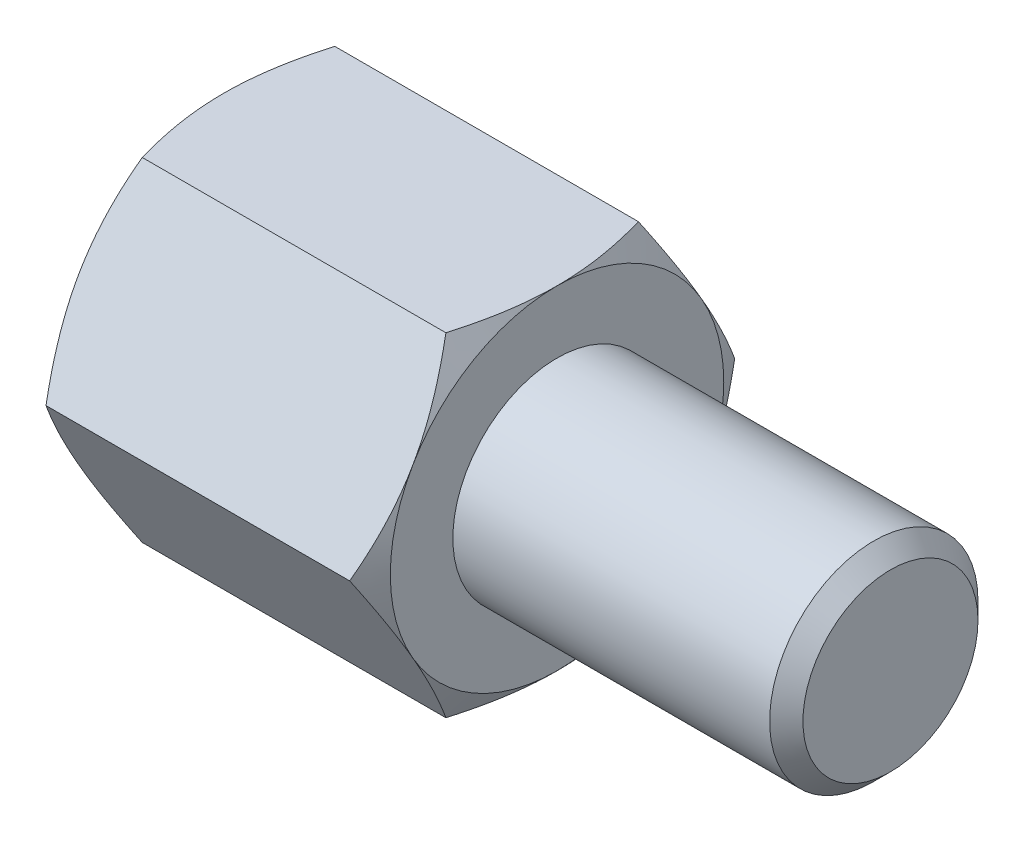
from build123d import *

# Parameters (mm, degrees)
EXTRUDE2_DEPTH = 4
SKETCH3_R      = 2.1
EXTRUDE3_DEPTH = 5
SKETCH5_R      = 2.5
EXTRUDE4_DEPTH = 8
CHAMFER1_SIZE  = 0.4


with BuildPart() as part:
    # Sketch1 → Extrude2 (new, symmetric)
    with BuildSketch(Plane(origin=(0, 0, 0), x_dir=(0, 0, -1), z_dir=(1, 0, 0))):
        Polygon((2.309401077, 4), (-2.309401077, 4), (-4.618802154, 0), (-2.309401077, -4), (2.309401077, -4), (4.618802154, 0), align=None)
    extrude(amount=EXTRUDE2_DEPTH, both=True)

    # Sketch2 → Cut-Revolve1 (revolve, cut)
    with BuildSketch(Plane.XY):
        with BuildLine():
            Line((-4, 4), (-2.5, 6.598076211))
            ThreePointArc((-2.5, 6.598076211), (-2.98810136, 7.776457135), (-4, 7))
            Line((-4, 7), (-4, 4))
        make_face()
    cut_revolve1 = revolve(axis=Axis((0, 0, 0), (1, 0, 0)), mode=Mode.SUBTRACT)

    # Mirror1: Cut-Revolve1 across plane
    add(cut_revolve1.mirror(Plane(origin=(0, 0, 0), x_dir=(0, 0, 1), z_dir=(1, 0, 0))), mode=Mode.SUBTRACT)

    # Sketch3 → Extrude3 (cut)
    with BuildSketch(Plane.ZY.offset(4)):
        Circle(SKETCH3_R)
    extrude(amount=-EXTRUDE3_DEPTH, mode=Mode.SUBTRACT)

    # Sketch4 → Cut-Revolve2 (revolve, cut)
    with BuildSketch(Plane.XY, mode=Mode.PRIVATE) as cut_revolve2_sk:
        Polygon((1, 0), (1, 2.1), (2.212435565, 0), align=None)
    revolve(cut_revolve2_sk.sketch.rotate(Axis((2.212435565, 0, 0), (-1, 0, 0)), 270), axis=Axis((2.212435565, 0, 0), (-1, 0, 0)), mode=Mode.SUBTRACT)

    # Sketch5 → Extrude4 (add)
    with BuildSketch(Plane(origin=(4, 0, 0), x_dir=(0, 0, -1), z_dir=(1, 0, 0))):
        Circle(SKETCH5_R)
    extrude(amount=EXTRUDE4_DEPTH)

    # Chamfer1
    chamfer1_edges = [part.edges().sort_by_distance(p)[0] for p in [
        (12, 0, 2.5),
    ]]
    chamfer(chamfer1_edges, length=CHAMFER1_SIZE)


solid = part.part
